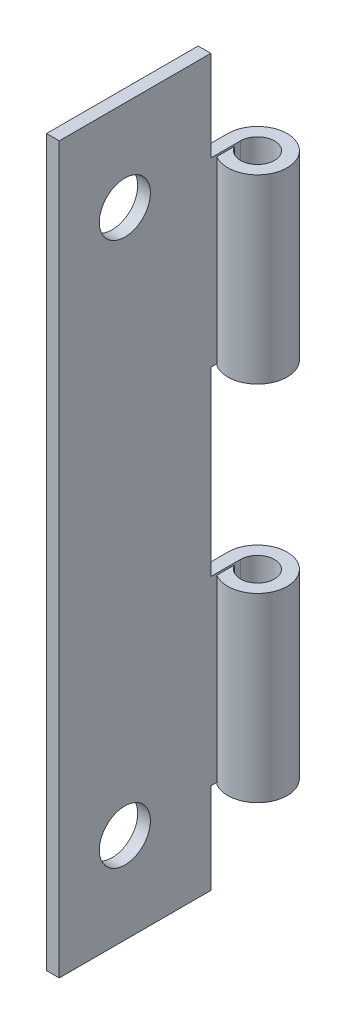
from build123d import *

# Parameters (mm, degrees)
BOSS_EXTRUDE2_DEPTH = 50.8
SKETCH16_W          = 4.15925
SKETCH16_H          = 6.35
SKETCH16_H_2        = 12.7
CUT_EXTRUDE7_DEPTH  = 53.528367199
SKETCH18_R          = 1.7907
CUT_EXTRUDE8_DEPTH  = 53.465460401


with BuildPart() as part:
    # Sketch4 → Boss-Extrude2 (new body)
    with BuildSketch(Plane(origin=(0, 0, 0), x_dir=(1, 0, 0), z_dir=(0, 1, 0))):
        with BuildLine():
            Line((0, 0), (0, -12.7))
            Line((0, -12.7), (0.889, -12.7))
            Line((0.889, -12.7), (0.889, 0))
            ThreePointArc((0.889, 0), (3.238064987, 0.274963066), (1.016, -0.535060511))
            Line((1.016, -0.535060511), (1.016, -1.787048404))
            ThreePointArc((1.016, -1.787048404), (3.887494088, 1.027837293), (0, 0))
        make_face()
    extrude(amount=BOSS_EXTRUDE2_DEPTH)

    # Sketch16 → Cut-Extrude7 (cut, through all)
    with BuildSketch(Plane(origin=(0, 0, 0), x_dir=(0, 0, -1), z_dir=(1, 0, 0))):
        with Locations((0, 47.625)):
            Rectangle(SKETCH16_W, SKETCH16_H)
        with Locations((0, 3.175)):
            Rectangle(SKETCH16_W, SKETCH16_H)
        with Locations((0, 25.4)):
            Rectangle(SKETCH16_W, SKETCH16_H_2)
    extrude(amount=CUT_EXTRUDE7_DEPTH, mode=Mode.SUBTRACT)

    # Sketch18 → Cut-Extrude8 (cut, through all)
    with BuildSketch(Plane(origin=(0.889, 0, 0), x_dir=(0, 0, -1), z_dir=(1, 0, 0))):
        with Locations((-8.1026, 6.35)):
            Circle(SKETCH18_R)
    cut_extrude8 = extrude(amount=-CUT_EXTRUDE8_DEPTH, mode=Mode.SUBTRACT)

    # Mirror1: Cut-Extrude8 across plane
    add(cut_extrude8.mirror(Plane.ZX.offset(25.4)), mode=Mode.SUBTRACT)


solid = part.part
